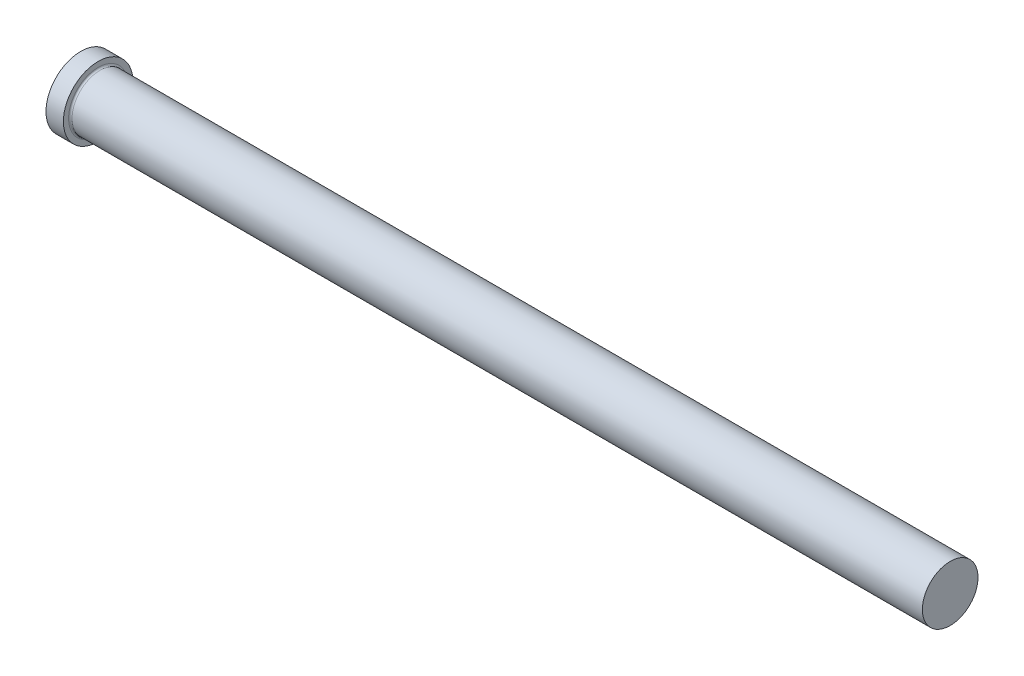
ISO-10303-21;
HEADER;
FILE_DESCRIPTION(('STEP AP214'),'2;1');
FILE_NAME('part.step','',(''),(''),'','','');
FILE_SCHEMA(('AUTOMOTIVE_DESIGN { 1 0 10303 214 1 1 1 1 }'));
ENDSEC;
DATA;
#1=APPLICATION_CONTEXT('core data for automotive mechanical design processes');
#2=APPLICATION_PROTOCOL_DEFINITION('international standard','automotive_design',2000,#1);
#3=PRODUCT_CONTEXT('',#1,'mechanical');
#4=PRODUCT('Part','Part','',(#3));
#5=PRODUCT_RELATED_PRODUCT_CATEGORY('part','',(#4));
#6=PRODUCT_DEFINITION_FORMATION('','',#4);
#7=PRODUCT_DEFINITION_CONTEXT('part definition',#1,'design');
#8=PRODUCT_DEFINITION('design','',#6,#7);
#9=PRODUCT_DEFINITION_SHAPE('','',#8);
#10=(LENGTH_UNIT() NAMED_UNIT(*) SI_UNIT(.MILLI.,.METRE.));
#11=(NAMED_UNIT(*) PLANE_ANGLE_UNIT() SI_UNIT($,.RADIAN.));
#12=(NAMED_UNIT(*) SI_UNIT($,.STERADIAN.) SOLID_ANGLE_UNIT());
#13=UNCERTAINTY_MEASURE_WITH_UNIT(LENGTH_MEASURE(1.E-05),#10,'distance_accuracy_value','');
#14=(GEOMETRIC_REPRESENTATION_CONTEXT(3) GLOBAL_UNCERTAINTY_ASSIGNED_CONTEXT((#13)) GLOBAL_UNIT_ASSIGNED_CONTEXT((#10,
#11,#12)) REPRESENTATION_CONTEXT('',''));
#15=CARTESIAN_POINT('',(0.,0.,0.));
#16=DIRECTION('',(0.,0.,1.));
#17=DIRECTION('',(1.,0.,0.));
#18=AXIS2_PLACEMENT_3D('',#15,#16,#17);
#19=CARTESIAN_POINT('',(0.,0.,0.));
#20=DIRECTION('',(-1.,0.,0.));
#21=DIRECTION('',(0.,-1.,0.));
#22=AXIS2_PLACEMENT_3D('',#19,#20,#21);
#23=PLANE('',#22);
#24=CARTESIAN_POINT('',(0.,0.,0.));
#25=DIRECTION('',(1.,0.,0.));
#26=DIRECTION('',(0.,1.,0.));
#27=AXIS2_PLACEMENT_3D('',#24,#25,#26);
#28=CIRCLE('',#27,20.);
#29=CARTESIAN_POINT('',(0.,20.,0.));
#30=VERTEX_POINT('',#29);
#31=EDGE_CURVE('E25',#30,#30,#28,.T.);
#32=ORIENTED_EDGE('',*,*,#31,.F.);
#33=EDGE_LOOP('',(#32));
#34=FACE_BOUND('',#33,.T.);
#35=ADVANCED_FACE('F14',(#34),#23,.T.);
#36=CARTESIAN_POINT('',(500.,0.,0.));
#37=DIRECTION('',(1.,0.,0.));
#38=DIRECTION('',(0.,1.,0.));
#39=AXIS2_PLACEMENT_3D('',#36,#37,#38);
#40=CYLINDRICAL_SURFACE('',#39,20.);
#41=ORIENTED_EDGE('',*,*,#31,.T.);
#42=EDGE_LOOP('',(#41));
#43=FACE_BOUND('',#42,.T.);
#44=CARTESIAN_POINT('',(10.,0.,0.));
#45=DIRECTION('',(1.,0.,0.));
#46=DIRECTION('',(0.,1.,0.));
#47=AXIS2_PLACEMENT_3D('',#44,#45,#46);
#48=CIRCLE('',#47,20.);
#49=CARTESIAN_POINT('',(10.,20.,0.));
#50=VERTEX_POINT('',#49);
#51=EDGE_CURVE('E29',#50,#50,#48,.T.);
#52=ORIENTED_EDGE('',*,*,#51,.F.);
#53=EDGE_LOOP('',(#52));
#54=FACE_BOUND('',#53,.T.);
#55=ADVANCED_FACE('F51',(#43,#54),#40,.T.);
#56=CARTESIAN_POINT('',(10.,20.,0.));
#57=DIRECTION('',(1.,0.,0.));
#58=DIRECTION('',(0.,1.,0.));
#59=AXIS2_PLACEMENT_3D('',#56,#57,#58);
#60=PLANE('',#59);
#61=CARTESIAN_POINT('',(10.,0.,0.));
#62=DIRECTION('',(1.,0.,0.));
#63=DIRECTION('',(0.,1.,0.));
#64=AXIS2_PLACEMENT_3D('',#61,#62,#63);
#65=CIRCLE('',#64,17.);
#66=CARTESIAN_POINT('',(10.,17.,0.));
#67=VERTEX_POINT('',#66);
#68=EDGE_CURVE('E9',#67,#67,#65,.F.);
#69=ORIENTED_EDGE('',*,*,#68,.T.);
#70=EDGE_LOOP('',(#69));
#71=FACE_BOUND('',#70,.T.);
#72=ORIENTED_EDGE('',*,*,#51,.T.);
#73=EDGE_LOOP('',(#72));
#74=FACE_BOUND('',#73,.T.);
#75=ADVANCED_FACE('F42',(#71,#74),#60,.T.);
#76=CARTESIAN_POINT('',(500.,0.,0.));
#77=DIRECTION('',(1.,0.,0.));
#78=DIRECTION('',(0.,1.,0.));
#79=AXIS2_PLACEMENT_3D('',#76,#77,#78);
#80=CYLINDRICAL_SURFACE('',#79,16.);
#81=CARTESIAN_POINT('',(11.,0.,0.));
#82=DIRECTION('',(1.,0.,0.));
#83=DIRECTION('',(0.,1.,0.));
#84=AXIS2_PLACEMENT_3D('',#81,#82,#83);
#85=CIRCLE('',#84,16.);
#86=CARTESIAN_POINT('',(11.,16.,0.));
#87=VERTEX_POINT('',#86);
#88=EDGE_CURVE('E21',#87,#87,#85,.T.);
#89=ORIENTED_EDGE('',*,*,#88,.T.);
#90=EDGE_LOOP('',(#89));
#91=FACE_BOUND('',#90,.T.);
#92=CARTESIAN_POINT('',(500.,0.,0.));
#93=DIRECTION('',(1.,0.,0.));
#94=DIRECTION('',(0.,1.,0.));
#95=AXIS2_PLACEMENT_3D('',#92,#93,#94);
#96=CIRCLE('',#95,16.);
#97=CARTESIAN_POINT('',(500.,16.,0.));
#98=VERTEX_POINT('',#97);
#99=EDGE_CURVE('E34',#98,#98,#96,.T.);
#100=ORIENTED_EDGE('',*,*,#99,.F.);
#101=EDGE_LOOP('',(#100));
#102=FACE_BOUND('',#101,.T.);
#103=ADVANCED_FACE('F40',(#91,#102),#80,.T.);
#104=CARTESIAN_POINT('',(500.,16.,0.));
#105=DIRECTION('',(1.,0.,0.));
#106=DIRECTION('',(0.,1.,0.));
#107=AXIS2_PLACEMENT_3D('',#104,#105,#106);
#108=PLANE('',#107);
#109=ORIENTED_EDGE('',*,*,#99,.T.);
#110=EDGE_LOOP('',(#109));
#111=FACE_BOUND('',#110,.T.);
#112=ADVANCED_FACE('F38',(#111),#108,.T.);
#113=CARTESIAN_POINT('',(11.,0.,0.));
#114=DIRECTION('',(1.,0.,0.));
#115=DIRECTION('',(0.,1.,0.));
#116=AXIS2_PLACEMENT_3D('',#113,#114,#115);
#117=TOROIDAL_SURFACE('',#116,17.,1.);
#118=ORIENTED_EDGE('',*,*,#68,.F.);
#119=EDGE_LOOP('',(#118));
#120=FACE_BOUND('',#119,.T.);
#121=ORIENTED_EDGE('',*,*,#88,.F.);
#122=EDGE_LOOP('',(#121));
#123=FACE_BOUND('',#122,.T.);
#124=ADVANCED_FACE('F16',(#120,#123),#117,.F.);
#125=CLOSED_SHELL('',(#35,#55,#75,#103,#112,#124));
#126=MANIFOLD_SOLID_BREP('B1',#125);
#127=ADVANCED_BREP_SHAPE_REPRESENTATION('',(#18,#126),#14);
#128=SHAPE_DEFINITION_REPRESENTATION(#9,#127);
ENDSEC;
END-ISO-10303-21;
